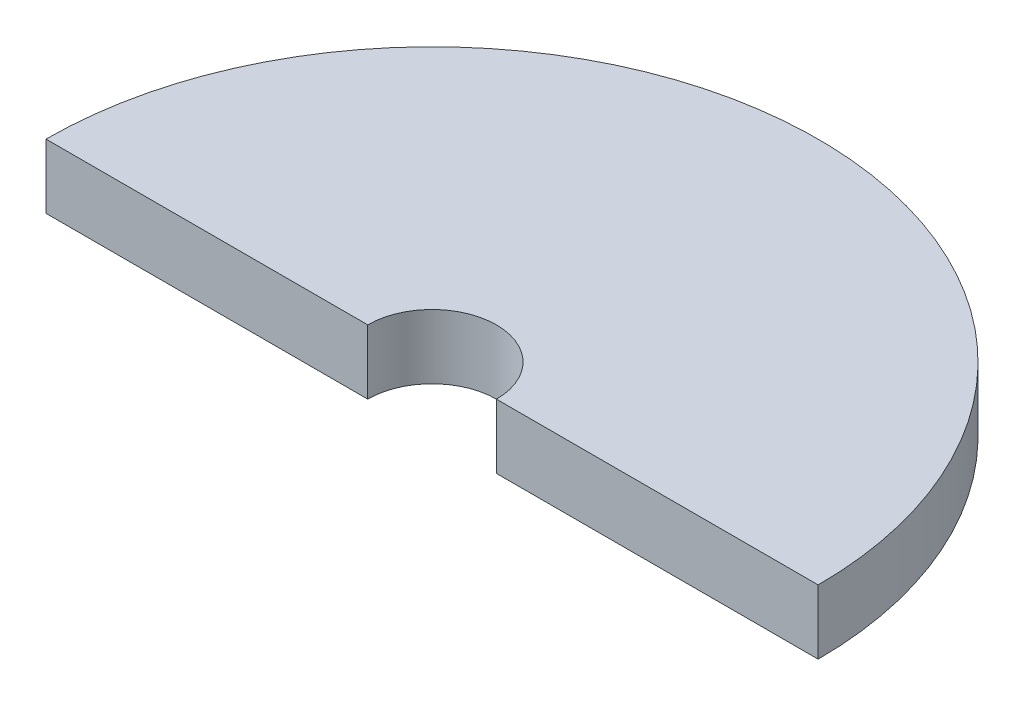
ISO-10303-21;
HEADER;
FILE_DESCRIPTION(('STEP AP214'),'2;1');
FILE_NAME('part.step','',(''),(''),'','','');
FILE_SCHEMA(('AUTOMOTIVE_DESIGN { 1 0 10303 214 1 1 1 1 }'));
ENDSEC;
DATA;
#1=APPLICATION_CONTEXT('core data for automotive mechanical design processes');
#2=APPLICATION_PROTOCOL_DEFINITION('international standard','automotive_design',2000,#1);
#3=PRODUCT_CONTEXT('',#1,'mechanical');
#4=PRODUCT('Part','Part','',(#3));
#5=PRODUCT_RELATED_PRODUCT_CATEGORY('part','',(#4));
#6=PRODUCT_DEFINITION_FORMATION('','',#4);
#7=PRODUCT_DEFINITION_CONTEXT('part definition',#1,'design');
#8=PRODUCT_DEFINITION('design','',#6,#7);
#9=PRODUCT_DEFINITION_SHAPE('','',#8);
#10=(LENGTH_UNIT() NAMED_UNIT(*) SI_UNIT(.MILLI.,.METRE.));
#11=(NAMED_UNIT(*) PLANE_ANGLE_UNIT() SI_UNIT($,.RADIAN.));
#12=(NAMED_UNIT(*) SI_UNIT($,.STERADIAN.) SOLID_ANGLE_UNIT());
#13=UNCERTAINTY_MEASURE_WITH_UNIT(LENGTH_MEASURE(1.E-05),#10,'distance_accuracy_value','');
#14=(GEOMETRIC_REPRESENTATION_CONTEXT(3) GLOBAL_UNCERTAINTY_ASSIGNED_CONTEXT((#13)) GLOBAL_UNIT_ASSIGNED_CONTEXT((#10,
#11,#12)) REPRESENTATION_CONTEXT('',''));
#15=CARTESIAN_POINT('',(0.,0.,0.));
#16=DIRECTION('',(0.,0.,1.));
#17=DIRECTION('',(1.,0.,0.));
#18=AXIS2_PLACEMENT_3D('',#15,#16,#17);
#19=CARTESIAN_POINT('',(0.,1.,0.));
#20=DIRECTION('',(0.,1.,0.));
#21=DIRECTION('',(0.,0.,1.));
#22=AXIS2_PLACEMENT_3D('',#19,#20,#21);
#23=PLANE('',#22);
#24=CARTESIAN_POINT('',(0.,1.,0.));
#25=DIRECTION('',(0.,1.,0.));
#26=DIRECTION('',(0.,0.,1.));
#27=AXIS2_PLACEMENT_3D('',#24,#25,#26);
#28=CIRCLE('',#27,6.);
#29=CARTESIAN_POINT('',(6.,1.,0.));
#30=VERTEX_POINT('',#29);
#31=CARTESIAN_POINT('',(-5.99999999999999,1.,0.));
#32=VERTEX_POINT('',#31);
#33=EDGE_CURVE('E87',#30,#32,#28,.T.);
#34=ORIENTED_EDGE('',*,*,#33,.T.);
#35=DIRECTION('',(1.,0.,0.));
#36=VECTOR('',#35,1.);
#37=CARTESIAN_POINT('',(0.,1.,0.));
#38=LINE('',#37,#36);
#39=CARTESIAN_POINT('',(-1.,1.,0.));
#40=VERTEX_POINT('',#39);
#41=EDGE_CURVE('E102',#32,#40,#38,.T.);
#42=ORIENTED_EDGE('',*,*,#41,.T.);
#43=CARTESIAN_POINT('',(0.,1.,0.));
#44=DIRECTION('',(0.,1.,0.));
#45=DIRECTION('',(0.,0.,1.));
#46=AXIS2_PLACEMENT_3D('',#43,#44,#45);
#47=CIRCLE('',#46,1.);
#48=CARTESIAN_POINT('',(1.,1.,0.));
#49=VERTEX_POINT('',#48);
#50=EDGE_CURVE('E90',#49,#40,#47,.T.);
#51=ORIENTED_EDGE('',*,*,#50,.F.);
#52=EDGE_CURVE('E55',#49,#30,#38,.T.);
#53=ORIENTED_EDGE('',*,*,#52,.T.);
#54=EDGE_LOOP('',(#34,#42,#51,#53));
#55=FACE_BOUND('',#54,.T.);
#56=ADVANCED_FACE('F33',(#55),#23,.T.);
#57=CARTESIAN_POINT('',(0.,0.,0.));
#58=DIRECTION('',(0.,1.,0.));
#59=DIRECTION('',(0.,0.,1.));
#60=AXIS2_PLACEMENT_3D('',#57,#58,#59);
#61=PLANE('',#60);
#62=DIRECTION('',(-1.,0.,0.));
#63=VECTOR('',#62,1.);
#64=CARTESIAN_POINT('',(0.,0.,0.));
#65=LINE('',#64,#63);
#66=CARTESIAN_POINT('',(-1.,0.,0.));
#67=VERTEX_POINT('',#66);
#68=CARTESIAN_POINT('',(-5.99999999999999,0.,0.));
#69=VERTEX_POINT('',#68);
#70=EDGE_CURVE('E48',#67,#69,#65,.T.);
#71=ORIENTED_EDGE('',*,*,#70,.T.);
#72=CARTESIAN_POINT('',(0.,0.,0.));
#73=DIRECTION('',(0.,1.,0.));
#74=DIRECTION('',(0.,0.,1.));
#75=AXIS2_PLACEMENT_3D('',#72,#73,#74);
#76=CIRCLE('',#75,6.);
#77=CARTESIAN_POINT('',(6.,0.,0.));
#78=VERTEX_POINT('',#77);
#79=EDGE_CURVE('E85',#78,#69,#76,.T.);
#80=ORIENTED_EDGE('',*,*,#79,.F.);
#81=CARTESIAN_POINT('',(1.,0.,0.));
#82=VERTEX_POINT('',#81);
#83=EDGE_CURVE('E71',#78,#82,#65,.T.);
#84=ORIENTED_EDGE('',*,*,#83,.T.);
#85=CARTESIAN_POINT('',(0.,0.,0.));
#86=DIRECTION('',(0.,1.,0.));
#87=DIRECTION('',(0.,0.,1.));
#88=AXIS2_PLACEMENT_3D('',#85,#86,#87);
#89=CIRCLE('',#88,1.);
#90=EDGE_CURVE('E94',#82,#67,#89,.T.);
#91=ORIENTED_EDGE('',*,*,#90,.T.);
#92=EDGE_LOOP('',(#71,#80,#84,#91));
#93=FACE_BOUND('',#92,.T.);
#94=ADVANCED_FACE('F89',(#93),#61,.F.);
#95=CARTESIAN_POINT('',(0.,1.,0.));
#96=DIRECTION('',(0.,-1.,0.));
#97=DIRECTION('',(0.,0.,-1.));
#98=AXIS2_PLACEMENT_3D('',#95,#96,#97);
#99=CYLINDRICAL_SURFACE('',#98,6.);
#100=DIRECTION('',(0.,1.,0.));
#101=VECTOR('',#100,1.);
#102=CARTESIAN_POINT('',(-5.99999999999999,0.,0.));
#103=LINE('',#102,#101);
#104=EDGE_CURVE('E79',#69,#32,#103,.T.);
#105=ORIENTED_EDGE('',*,*,#104,.T.);
#106=ORIENTED_EDGE('',*,*,#33,.F.);
#107=DIRECTION('',(0.,1.,0.));
#108=VECTOR('',#107,1.);
#109=CARTESIAN_POINT('',(6.,0.,0.));
#110=LINE('',#109,#108);
#111=EDGE_CURVE('E74',#78,#30,#110,.T.);
#112=ORIENTED_EDGE('',*,*,#111,.F.);
#113=ORIENTED_EDGE('',*,*,#79,.T.);
#114=EDGE_LOOP('',(#105,#106,#112,#113));
#115=FACE_BOUND('',#114,.T.);
#116=ADVANCED_FACE('F35',(#115),#99,.T.);
#117=CARTESIAN_POINT('',(0.,1.,0.));
#118=DIRECTION('',(0.,-1.,0.));
#119=DIRECTION('',(0.,0.,-1.));
#120=AXIS2_PLACEMENT_3D('',#117,#118,#119);
#121=CYLINDRICAL_SURFACE('',#120,1.);
#122=ORIENTED_EDGE('',*,*,#50,.T.);
#123=DIRECTION('',(0.,-1.,0.));
#124=VECTOR('',#123,1.);
#125=CARTESIAN_POINT('',(-1.,1.,0.));
#126=LINE('',#125,#124);
#127=EDGE_CURVE('E11',#40,#67,#126,.T.);
#128=ORIENTED_EDGE('',*,*,#127,.T.);
#129=ORIENTED_EDGE('',*,*,#90,.F.);
#130=DIRECTION('',(0.,-1.,0.));
#131=VECTOR('',#130,1.);
#132=CARTESIAN_POINT('',(1.,1.,0.));
#133=LINE('',#132,#131);
#134=EDGE_CURVE('E41',#82,#49,#133,.F.);
#135=ORIENTED_EDGE('',*,*,#134,.T.);
#136=EDGE_LOOP('',(#122,#128,#129,#135));
#137=FACE_BOUND('',#136,.T.);
#138=ADVANCED_FACE('F99',(#137),#121,.F.);
#139=CARTESIAN_POINT('',(0.,1.,0.));
#140=DIRECTION('',(0.,0.,1.));
#141=DIRECTION('',(1.,0.,0.));
#142=AXIS2_PLACEMENT_3D('',#139,#140,#141);
#143=PLANE('',#142);
#144=ORIENTED_EDGE('',*,*,#83,.F.);
#145=ORIENTED_EDGE('',*,*,#111,.T.);
#146=ORIENTED_EDGE('',*,*,#52,.F.);
#147=ORIENTED_EDGE('',*,*,#134,.F.);
#148=EDGE_LOOP('',(#144,#145,#146,#147));
#149=FACE_BOUND('',#148,.T.);
#150=ADVANCED_FACE('F73',(#149),#143,.T.);
#151=ORIENTED_EDGE('',*,*,#41,.F.);
#152=ORIENTED_EDGE('',*,*,#104,.F.);
#153=ORIENTED_EDGE('',*,*,#70,.F.);
#154=ORIENTED_EDGE('',*,*,#127,.F.);
#155=EDGE_LOOP('',(#151,#152,#153,#154));
#156=FACE_BOUND('',#155,.T.);
#157=ADVANCED_FACE('F105',(#156),#143,.T.);
#158=CLOSED_SHELL('',(#56,#94,#116,#138,#150,#157));
#159=MANIFOLD_SOLID_BREP('B2',#158);
#160=ADVANCED_BREP_SHAPE_REPRESENTATION('',(#18,#159),#14);
#161=SHAPE_DEFINITION_REPRESENTATION(#9,#160);
ENDSEC;
END-ISO-10303-21;
